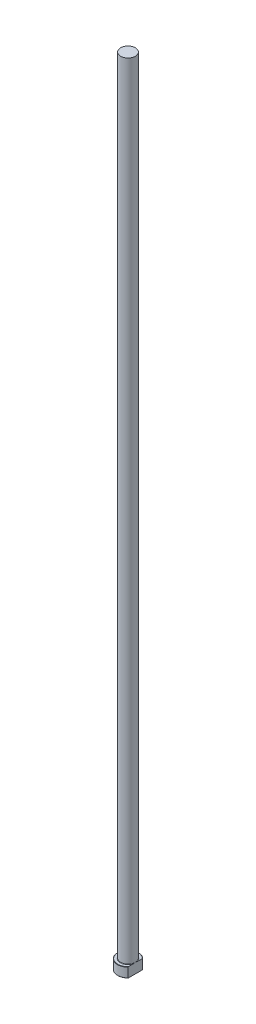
ISO-10303-21;
HEADER;
FILE_DESCRIPTION(('STEP AP214'),'2;1');
FILE_NAME('part.step','',(''),(''),'','','');
FILE_SCHEMA(('AUTOMOTIVE_DESIGN { 1 0 10303 214 1 1 1 1 }'));
ENDSEC;
DATA;
#1=APPLICATION_CONTEXT('core data for automotive mechanical design processes');
#2=APPLICATION_PROTOCOL_DEFINITION('international standard','automotive_design',2000,#1);
#3=PRODUCT_CONTEXT('',#1,'mechanical');
#4=PRODUCT('Part','Part','',(#3));
#5=PRODUCT_RELATED_PRODUCT_CATEGORY('part','',(#4));
#6=PRODUCT_DEFINITION_FORMATION('','',#4);
#7=PRODUCT_DEFINITION_CONTEXT('part definition',#1,'design');
#8=PRODUCT_DEFINITION('design','',#6,#7);
#9=PRODUCT_DEFINITION_SHAPE('','',#8);
#10=(LENGTH_UNIT() NAMED_UNIT(*) SI_UNIT(.MILLI.,.METRE.));
#11=(NAMED_UNIT(*) PLANE_ANGLE_UNIT() SI_UNIT($,.RADIAN.));
#12=(NAMED_UNIT(*) SI_UNIT($,.STERADIAN.) SOLID_ANGLE_UNIT());
#13=UNCERTAINTY_MEASURE_WITH_UNIT(LENGTH_MEASURE(1.E-05),#10,'distance_accuracy_value','');
#14=(GEOMETRIC_REPRESENTATION_CONTEXT(3) GLOBAL_UNCERTAINTY_ASSIGNED_CONTEXT((#13)) GLOBAL_UNIT_ASSIGNED_CONTEXT((#10,
#11,#12)) REPRESENTATION_CONTEXT('',''));
#15=CARTESIAN_POINT('',(0.,0.,0.));
#16=DIRECTION('',(0.,0.,1.));
#17=DIRECTION('',(1.,0.,0.));
#18=AXIS2_PLACEMENT_3D('',#15,#16,#17);
#19=CARTESIAN_POINT('',(0.,0.,0.));
#20=DIRECTION('',(0.,-1.,0.));
#21=DIRECTION('',(0.,0.,-1.));
#22=AXIS2_PLACEMENT_3D('',#19,#20,#21);
#23=PLANE('',#22);
#24=CARTESIAN_POINT('',(0.,0.,0.));
#25=DIRECTION('',(0.,-1.,0.));
#26=DIRECTION('',(0.,0.,-1.));
#27=AXIS2_PLACEMENT_3D('',#24,#25,#26);
#28=CIRCLE('',#27,8.29999999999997);
#29=CARTESIAN_POINT('',(5.99999999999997,0.,5.73498038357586));
#30=VERTEX_POINT('',#29);
#31=CARTESIAN_POINT('',(5.99999999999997,0.,-5.73498038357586));
#32=VERTEX_POINT('',#31);
#33=EDGE_CURVE('E98',#30,#32,#28,.T.);
#34=ORIENTED_EDGE('',*,*,#33,.T.);
#35=DIRECTION('',(0.,0.,1.));
#36=VECTOR('',#35,1.);
#37=CARTESIAN_POINT('',(5.99999999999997,0.,6.02079728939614));
#38=LINE('',#37,#36);
#39=EDGE_CURVE('E83',#32,#30,#38,.T.);
#40=ORIENTED_EDGE('',*,*,#39,.T.);
#41=EDGE_LOOP('',(#34,#40));
#42=FACE_BOUND('',#41,.T.);
#43=ADVANCED_FACE('F32',(#42),#23,.T.);
#44=CARTESIAN_POINT('',(0.,259.958771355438,0.));
#45=DIRECTION('',(0.,1.,0.));
#46=DIRECTION('',(0.,0.,1.));
#47=AXIS2_PLACEMENT_3D('',#44,#45,#46);
#48=CYLINDRICAL_SURFACE('',#47,8.49999999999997);
#49=CARTESIAN_POINT('',(0.,7.80000000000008,0.));
#50=DIRECTION('',(0.,1.,0.));
#51=DIRECTION('',(0.,0.,1.));
#52=AXIS2_PLACEMENT_3D('',#49,#50,#51);
#53=CIRCLE('',#52,8.49999999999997);
#54=CARTESIAN_POINT('',(5.99999999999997,7.80000000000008,6.02079728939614));
#55=VERTEX_POINT('',#54);
#56=CARTESIAN_POINT('',(5.99999999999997,7.80000000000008,-6.02079728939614));
#57=VERTEX_POINT('',#56);
#58=EDGE_CURVE('E104',#55,#57,#53,.F.);
#59=ORIENTED_EDGE('',*,*,#58,.T.);
#60=DIRECTION('',(0.,-1.,0.));
#61=VECTOR('',#60,1.);
#62=CARTESIAN_POINT('',(5.99999999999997,650.,-6.02079728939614));
#63=LINE('',#62,#61);
#64=CARTESIAN_POINT('',(5.99999999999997,0.200000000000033,-6.02079728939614));
#65=VERTEX_POINT('',#64);
#66=EDGE_CURVE('E183',#57,#65,#63,.T.);
#67=ORIENTED_EDGE('',*,*,#66,.T.);
#68=CARTESIAN_POINT('',(0.,0.200000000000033,0.));
#69=DIRECTION('',(0.,-1.,0.));
#70=DIRECTION('',(0.,0.,-1.));
#71=AXIS2_PLACEMENT_3D('',#68,#69,#70);
#72=CIRCLE('',#71,8.49999999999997);
#73=CARTESIAN_POINT('',(5.99999999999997,0.200000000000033,6.02079728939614));
#74=VERTEX_POINT('',#73);
#75=EDGE_CURVE('E100',#65,#74,#72,.F.);
#76=ORIENTED_EDGE('',*,*,#75,.T.);
#77=DIRECTION('',(0.,-1.,0.));
#78=VECTOR('',#77,1.);
#79=CARTESIAN_POINT('',(5.99999999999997,650.,6.02079728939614));
#80=LINE('',#79,#78);
#81=EDGE_CURVE('E93',#55,#74,#80,.T.);
#82=ORIENTED_EDGE('',*,*,#81,.F.);
#83=EDGE_LOOP('',(#59,#67,#76,#82));
#84=FACE_BOUND('',#83,.T.);
#85=ADVANCED_FACE('F158',(#84),#48,.T.);
#86=CARTESIAN_POINT('',(-8.49999999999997,8.,0.));
#87=DIRECTION('',(0.,1.,0.));
#88=DIRECTION('',(0.,0.,1.));
#89=AXIS2_PLACEMENT_3D('',#86,#87,#88);
#90=PLANE('',#89);
#91=CARTESIAN_POINT('',(0.,8.,0.));
#92=DIRECTION('',(0.,1.,0.));
#93=DIRECTION('',(0.,0.,1.));
#94=AXIS2_PLACEMENT_3D('',#91,#92,#93);
#95=CIRCLE('',#94,8.30000000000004);
#96=CARTESIAN_POINT('',(5.99999999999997,8.,-5.73498038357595));
#97=VERTEX_POINT('',#96);
#98=CARTESIAN_POINT('',(5.99999999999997,8.,5.73498038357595));
#99=VERTEX_POINT('',#98);
#100=EDGE_CURVE('E178',#97,#99,#95,.T.);
#101=ORIENTED_EDGE('',*,*,#100,.T.);
#102=DIRECTION('',(0.,0.,-1.));
#103=VECTOR('',#102,1.);
#104=CARTESIAN_POINT('',(5.99999999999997,8.,0.));
#105=LINE('',#104,#103);
#106=CARTESIAN_POINT('',(5.99999999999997,7.99999999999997,1.92093727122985));
#107=VERTEX_POINT('',#106);
#108=EDGE_CURVE('E57',#99,#107,#105,.T.);
#109=ORIENTED_EDGE('',*,*,#108,.T.);
#110=CARTESIAN_POINT('',(0.,8.,0.));
#111=DIRECTION('',(0.,1.,0.));
#112=DIRECTION('',(0.,0.,1.));
#113=AXIS2_PLACEMENT_3D('',#110,#111,#112);
#114=CIRCLE('',#113,6.29999999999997);
#115=CARTESIAN_POINT('',(5.99999999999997,7.99999999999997,-1.92093727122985));
#116=VERTEX_POINT('',#115);
#117=EDGE_CURVE('E107',#107,#116,#114,.F.);
#118=ORIENTED_EDGE('',*,*,#117,.T.);
#119=EDGE_CURVE('E136',#116,#97,#105,.T.);
#120=ORIENTED_EDGE('',*,*,#119,.T.);
#121=EDGE_LOOP('',(#101,#109,#118,#120));
#122=FACE_BOUND('',#121,.T.);
#123=ADVANCED_FACE('F147',(#122),#90,.T.);
#124=CARTESIAN_POINT('',(0.,8.00000000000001,0.));
#125=DIRECTION('',(0.,-1.,0.));
#126=DIRECTION('',(0.,0.,-1.));
#127=AXIS2_PLACEMENT_3D('',#124,#125,#126);
#128=CONICAL_SURFACE('',#127,8.30000000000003,0.785398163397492);
#129=ORIENTED_EDGE('',*,*,#58,.F.);
#130=CARTESIAN_POINT('',(5.99999999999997,1.75758968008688,13.2469505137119));
#131=CARTESIAN_POINT('',(5.99999999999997,1.93438223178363,13.0528651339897));
#132=CARTESIAN_POINT('',(5.99999999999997,2.11081737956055,12.8584542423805));
#133=CARTESIAN_POINT('',(5.99999999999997,2.4628681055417,12.4688887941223));
#134=CARTESIAN_POINT('',(5.99999999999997,2.63848367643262,12.2737342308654));
#135=CARTESIAN_POINT('',(5.99999999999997,3.16402789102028,11.6869221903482));
#136=CARTESIAN_POINT('',(5.99999999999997,3.51256436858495,11.2940145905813));
#137=CARTESIAN_POINT('',(5.99999999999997,4.20737297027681,10.5008820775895));
#138=CARTESIAN_POINT('',(5.99999999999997,4.55360756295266,10.1006242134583));
#139=CARTESIAN_POINT('',(5.99999999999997,5.23924501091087,9.29437446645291));
#140=CARTESIAN_POINT('',(5.99999999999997,5.57864880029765,8.88838338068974));
#141=CARTESIAN_POINT('',(5.99999999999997,6.20014365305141,8.12701556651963));
#142=CARTESIAN_POINT('',(5.99999999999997,6.48350363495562,7.77268056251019));
#143=CARTESIAN_POINT('',(5.99999999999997,6.9011847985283,7.23535305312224));
#144=CARTESIAN_POINT('',(5.99999999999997,7.03920968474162,7.05523994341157));
#145=CARTESIAN_POINT('',(5.99999999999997,7.31228512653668,6.6927759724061));
#146=CARTESIAN_POINT('',(5.99999999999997,7.44733576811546,6.51042517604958));
#147=CARTESIAN_POINT('',(5.99999999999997,7.7136549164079,6.14339029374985));
#148=CARTESIAN_POINT('',(5.99999999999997,7.84492875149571,5.9587100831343));
#149=CARTESIAN_POINT('',(5.99999999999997,8.10310710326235,5.586328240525));
#150=CARTESIAN_POINT('',(5.99999999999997,8.23001189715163,5.3986268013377));
#151=CARTESIAN_POINT('',(5.99999999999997,8.47838103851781,5.01977879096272));
#152=CARTESIAN_POINT('',(5.99999999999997,8.59984807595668,4.82863399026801));
#153=CARTESIAN_POINT('',(5.99999999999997,8.83606873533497,4.44225695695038));
#154=CARTESIAN_POINT('',(5.99999999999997,8.95082335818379,4.24702533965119));
#155=CARTESIAN_POINT('',(5.99999999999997,9.16834438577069,3.8581909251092));
#156=CARTESIAN_POINT('',(5.99999999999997,9.27137801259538,3.66473854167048));
#157=CARTESIAN_POINT('',(5.99999999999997,9.46754050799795,3.27281000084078));
#158=CARTESIAN_POINT('',(5.99999999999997,9.56066848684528,3.07433339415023));
#159=CARTESIAN_POINT('',(5.99999999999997,9.73431152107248,2.67227927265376));
#160=CARTESIAN_POINT('',(5.99999999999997,9.81484758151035,2.46871092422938));
#161=CARTESIAN_POINT('',(5.99999999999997,9.96042306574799,2.05607448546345));
#162=CARTESIAN_POINT('',(5.99999999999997,10.0254667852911,1.84700793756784));
#163=CARTESIAN_POINT('',(5.99999999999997,10.1264114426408,1.46315432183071));
#164=CARTESIAN_POINT('',(5.99999999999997,10.1654805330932,1.28920535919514));
#165=CARTESIAN_POINT('',(5.99999999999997,10.2294553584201,0.938706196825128));
#166=CARTESIAN_POINT('',(5.99999999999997,10.2543631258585,0.762156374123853));
#167=CARTESIAN_POINT('',(5.99999999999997,10.2887297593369,0.40789035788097));
#168=CARTESIAN_POINT('',(5.99999999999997,10.2982190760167,0.230177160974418));
#169=CARTESIAN_POINT('',(5.99999999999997,10.301323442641,-0.125392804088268));
#170=CARTESIAN_POINT('',(5.99999999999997,10.2949382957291,-0.303249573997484));
#171=CARTESIAN_POINT('',(5.99999999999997,10.2666831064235,-0.657249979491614));
#172=CARTESIAN_POINT('',(5.99999999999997,10.2448527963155,-0.83339683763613));
#173=CARTESIAN_POINT('',(5.99999999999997,10.1868620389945,-1.18332422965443));
#174=CARTESIAN_POINT('',(5.99999999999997,10.1506981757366,-1.35710418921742));
#175=CARTESIAN_POINT('',(5.99999999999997,10.0655340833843,-1.70193222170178));
#176=CARTESIAN_POINT('',(5.99999999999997,10.0165006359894,-1.87297199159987));
#177=CARTESIAN_POINT('',(5.99999999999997,9.90743707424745,-2.21145638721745));
#178=CARTESIAN_POINT('',(5.99999999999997,9.84740753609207,-2.37890120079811));
#179=CARTESIAN_POINT('',(5.99999999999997,9.69449933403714,-2.77055604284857));
#180=CARTESIAN_POINT('',(5.99999999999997,9.597624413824,-2.99320000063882));
#181=CARTESIAN_POINT('',(5.99999999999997,9.39041412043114,-3.43217897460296));
#182=CARTESIAN_POINT('',(5.99999999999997,9.28007160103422,-3.64851056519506));
#183=CARTESIAN_POINT('',(5.99999999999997,9.04872697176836,-4.07594347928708));
#184=CARTESIAN_POINT('',(5.99999999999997,8.92770286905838,-4.28703280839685));
#185=CARTESIAN_POINT('',(5.99999999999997,8.67752421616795,-4.70425268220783));
#186=CARTESIAN_POINT('',(5.99999999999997,8.54837109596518,-4.91038409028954));
#187=CARTESIAN_POINT('',(5.99999999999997,8.28223284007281,-5.32064004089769));
#188=CARTESIAN_POINT('',(5.99999999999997,8.1451788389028,-5.52471970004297));
#189=CARTESIAN_POINT('',(5.99999999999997,7.86585169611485,-5.92927121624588));
#190=CARTESIAN_POINT('',(5.99999999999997,7.72357838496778,-6.12974295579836));
#191=CARTESIAN_POINT('',(5.99999999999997,7.43500571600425,-6.52738897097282));
#192=CARTESIAN_POINT('',(5.99999999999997,7.28871143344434,-6.72456694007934));
#193=CARTESIAN_POINT('',(5.99999999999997,6.99270011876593,-7.11633919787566));
#194=CARTESIAN_POINT('',(5.99999999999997,6.84298299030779,-7.31093341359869));
#195=CARTESIAN_POINT('',(5.99999999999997,6.4945641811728,-7.75702816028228));
#196=CARTESIAN_POINT('',(5.99999999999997,6.29487025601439,-8.00775292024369));
#197=CARTESIAN_POINT('',(5.99999999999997,5.89169138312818,-8.50613413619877));
#198=CARTESIAN_POINT('',(5.99999999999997,5.68820636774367,-8.75379053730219));
#199=CARTESIAN_POINT('',(5.99999999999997,5.27809760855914,-9.24667622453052));
#200=CARTESIAN_POINT('',(5.99999999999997,5.07147248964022,-9.4919043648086));
#201=CARTESIAN_POINT('',(5.99999999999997,4.65573644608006,-9.98024423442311));
#202=CARTESIAN_POINT('',(5.99999999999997,4.44662550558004,-10.2233559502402));
#203=CARTESIAN_POINT('',(5.99999999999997,4.03294810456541,-10.7001949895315));
#204=CARTESIAN_POINT('',(5.99999999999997,3.82844502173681,-10.9339773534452));
#205=CARTESIAN_POINT('',(5.99999999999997,3.41782118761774,-11.4001180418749));
#206=CARTESIAN_POINT('',(5.99999999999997,3.21170042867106,-11.6324763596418));
#207=CARTESIAN_POINT('',(5.99999999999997,2.79824862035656,-12.0957939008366));
#208=CARTESIAN_POINT('',(5.99999999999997,2.5909186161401,-12.3267540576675));
#209=CARTESIAN_POINT('',(5.99999999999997,2.17508648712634,-12.7876097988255));
#210=CARTESIAN_POINT('',(5.99999999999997,1.9665843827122,-13.0175054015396));
#211=CARTESIAN_POINT('',(5.99999999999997,1.75758968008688,-13.2469505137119));
#212=B_SPLINE_CURVE_WITH_KNOTS('',3,(#130,#131,#132,#133,#134,#135,#136,#137,#138,#139,#140,
#141,#142,#143,#144,#145,#146,#147,#148,#149,#150,#151,#152,#153,#154,#155,#156,#157,#158,#159,
#160,#161,#162,#163,#164,#165,#166,#167,#168,#169,#170,#171,#172,#173,#174,#175,#176,#177,#178,
#179,#180,#181,#182,#183,#184,#185,#186,#187,#188,#189,#190,#191,#192,#193,#194,#195,#196,#197,
#198,#199,#200,#201,#202,#203,#204,#205,#206,#207,#208,#209,#210,#211),.UNSPECIFIED.,.F.,.F.,(4,
2,2,2,2,2,2,2,2,2,2,2,2,2,2,2,2,2,2,2,2,2,2,2,2,2,2,2,2,2,2,2,2,2,2,2,2,2,2,2,4),(0.,
0.787604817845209,1.57521665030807,3.15083930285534,4.73847641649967,6.32589492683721,
7.68685989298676,8.36758868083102,9.04829776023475,9.72799402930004,10.4076470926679,
11.0869601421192,11.7661716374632,12.4234853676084,13.0808580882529,13.7371222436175,
14.3932042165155,14.9275387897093,15.4617966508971,15.9949980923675,16.5282061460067,
17.0600474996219,17.5920156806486,18.1253706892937,18.6586977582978,19.3865060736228,
20.1147022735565,20.8444344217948,21.5740385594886,22.3114278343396,23.0488410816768,
23.7853628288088,24.5219053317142,25.4834511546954,26.4450141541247,27.4070111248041,
28.3690142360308,29.3008217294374,30.2326336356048,31.1637335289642,32.0948172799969),.UNSPECIFIED.);
#213=EDGE_CURVE('E135',#55,#99,#212,.T.);
#214=ORIENTED_EDGE('',*,*,#213,.T.);
#215=ORIENTED_EDGE('',*,*,#100,.F.);
#216=EDGE_CURVE('E127',#97,#57,#212,.T.);
#217=ORIENTED_EDGE('',*,*,#216,.T.);
#218=EDGE_LOOP('',(#129,#214,#215,#217));
#219=FACE_BOUND('',#218,.T.);
#220=ADVANCED_FACE('F143',(#219),#128,.T.);
#221=CARTESIAN_POINT('',(0.,0.200000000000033,0.));
#222=DIRECTION('',(0.,1.,0.));
#223=DIRECTION('',(0.,0.,1.));
#224=AXIS2_PLACEMENT_3D('',#221,#222,#223);
#225=CONICAL_SURFACE('',#224,8.49999999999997,0.785398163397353);
#226=ORIENTED_EDGE('',*,*,#75,.F.);
#227=CARTESIAN_POINT('',(5.99999999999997,6.24241031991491,-13.2469505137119));
#228=CARTESIAN_POINT('',(5.99999999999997,6.06561776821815,-13.0528651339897));
#229=CARTESIAN_POINT('',(5.99999999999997,5.88918262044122,-12.8584542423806));
#230=CARTESIAN_POINT('',(5.99999999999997,5.53713189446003,-12.4688887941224));
#231=CARTESIAN_POINT('',(5.99999999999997,5.36151632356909,-12.2737342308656));
#232=CARTESIAN_POINT('',(5.99999999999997,4.83597210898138,-11.6869221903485));
#233=CARTESIAN_POINT('',(5.99999999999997,4.48743563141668,-11.2940145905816));
#234=CARTESIAN_POINT('',(5.99999999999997,3.79262702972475,-10.50088207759));
#235=CARTESIAN_POINT('',(5.99999999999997,3.44639243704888,-10.1006242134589));
#236=CARTESIAN_POINT('',(5.99999999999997,2.7607549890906,-9.29437446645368));
#237=CARTESIAN_POINT('',(5.99999999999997,2.42135119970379,-8.88838338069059));
#238=CARTESIAN_POINT('',(5.99999999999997,1.79985634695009,-8.12701556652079));
#239=CARTESIAN_POINT('',(5.99999999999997,1.51649636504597,-7.77268056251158));
#240=CARTESIAN_POINT('',(5.99999999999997,1.09881520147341,-7.23535305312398));
#241=CARTESIAN_POINT('',(5.99999999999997,0.960790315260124,-7.05523994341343));
#242=CARTESIAN_POINT('',(5.99999999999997,0.687714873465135,-6.69277597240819));
#243=CARTESIAN_POINT('',(5.99999999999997,0.552664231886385,-6.5104251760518));
#244=CARTESIAN_POINT('',(5.99999999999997,0.286345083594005,-6.14339029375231));
#245=CARTESIAN_POINT('',(5.99999999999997,0.15507124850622,-5.95871008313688));
#246=CARTESIAN_POINT('',(5.99999999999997,-0.103107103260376,-5.58632824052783));
#247=CARTESIAN_POINT('',(5.99999999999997,-0.230011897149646,-5.39862680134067));
#248=CARTESIAN_POINT('',(5.99999999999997,-0.478381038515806,-5.01977879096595));
#249=CARTESIAN_POINT('',(5.99999999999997,-0.599848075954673,-4.82863399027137));
#250=CARTESIAN_POINT('',(5.99999999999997,-0.83606873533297,-4.44225695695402));
#251=CARTESIAN_POINT('',(5.99999999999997,-0.950823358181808,-4.24702533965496));
#252=CARTESIAN_POINT('',(5.99999999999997,-1.16834438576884,-3.8581909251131));
#253=CARTESIAN_POINT('',(5.99999999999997,-1.27137801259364,-3.66473854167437));
#254=CARTESIAN_POINT('',(5.99999999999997,-1.46754050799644,-3.27281000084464));
#255=CARTESIAN_POINT('',(5.99999999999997,-1.5606684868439,-3.07433339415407));
#256=CARTESIAN_POINT('',(5.99999999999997,-1.73431152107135,-2.67227927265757));
#257=CARTESIAN_POINT('',(5.99999999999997,-1.81484758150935,-2.46871092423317));
#258=CARTESIAN_POINT('',(5.99999999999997,-1.96042306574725,-2.05607448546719));
#259=CARTESIAN_POINT('',(5.99999999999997,-2.02546678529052,-1.84700793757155));
#260=CARTESIAN_POINT('',(5.99999999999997,-2.12641144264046,-1.46315432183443));
#261=CARTESIAN_POINT('',(5.99999999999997,-2.16548053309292,-1.28920535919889));
#262=CARTESIAN_POINT('',(5.99999999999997,-2.22945535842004,-0.938706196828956));
#263=CARTESIAN_POINT('',(5.99999999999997,-2.25436312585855,-0.762156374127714));
#264=CARTESIAN_POINT('',(5.99999999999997,-2.28872975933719,-0.407890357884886));
#265=CARTESIAN_POINT('',(5.99999999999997,-2.29821907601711,-0.230177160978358));
#266=CARTESIAN_POINT('',(5.99999999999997,-2.30132344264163,0.12539280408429));
#267=CARTESIAN_POINT('',(5.99999999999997,-2.29493829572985,0.303249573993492));
#268=CARTESIAN_POINT('',(5.99999999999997,-2.26668310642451,0.657249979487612));
#269=CARTESIAN_POINT('',(5.99999999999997,-2.2448527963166,0.833396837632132));
#270=CARTESIAN_POINT('',(5.99999999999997,-2.1868620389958,1.18332422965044));
#271=CARTESIAN_POINT('',(5.99999999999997,-2.150698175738,1.35710418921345));
#272=CARTESIAN_POINT('',(5.99999999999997,-2.06553408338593,1.70193222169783));
#273=CARTESIAN_POINT('',(5.99999999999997,-2.01650063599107,1.87297199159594));
#274=CARTESIAN_POINT('',(5.99999999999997,-1.90743707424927,2.21145638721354));
#275=CARTESIAN_POINT('',(5.99999999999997,-1.84740753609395,2.37890120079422));
#276=CARTESIAN_POINT('',(5.99999999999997,-1.69449933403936,2.77055604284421));
#277=CARTESIAN_POINT('',(5.99999999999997,-1.59762441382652,2.99320000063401));
#278=CARTESIAN_POINT('',(5.99999999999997,-1.39041412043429,3.43217897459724));
#279=CARTESIAN_POINT('',(5.99999999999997,-1.28007160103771,3.6485105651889));
#280=CARTESIAN_POINT('',(5.99999999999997,-1.04872697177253,4.07594347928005));
#281=CARTESIAN_POINT('',(5.99999999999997,-0.927702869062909,4.2870328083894));
#282=CARTESIAN_POINT('',(5.99999999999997,-0.677524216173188,4.70425268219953));
#283=CARTESIAN_POINT('',(5.99999999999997,-0.548371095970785,4.91038409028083));
#284=CARTESIAN_POINT('',(5.99999999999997,-0.282232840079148,5.32064004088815));
#285=CARTESIAN_POINT('',(5.99999999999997,-0.145178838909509,5.52471970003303));
#286=CARTESIAN_POINT('',(5.99999999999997,0.134148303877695,5.92927121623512));
#287=CARTESIAN_POINT('',(5.99999999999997,0.276421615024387,6.12974295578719));
#288=CARTESIAN_POINT('',(5.99999999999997,0.564994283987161,6.52738897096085));
#289=CARTESIAN_POINT('',(5.99999999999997,0.711288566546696,6.72456694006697));
#290=CARTESIAN_POINT('',(5.99999999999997,1.00729988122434,7.11633919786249));
#291=CARTESIAN_POINT('',(5.99999999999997,1.15701700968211,7.31093341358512));
#292=CARTESIAN_POINT('',(5.99999999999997,1.50543581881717,7.757028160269));
#293=CARTESIAN_POINT('',(5.99999999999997,1.70512974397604,8.00775292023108));
#294=CARTESIAN_POINT('',(5.99999999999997,2.10830861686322,8.50613413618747));
#295=CARTESIAN_POINT('',(5.99999999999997,2.31179363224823,8.75379053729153));
#296=CARTESIAN_POINT('',(5.99999999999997,2.72190239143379,9.24667622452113));
#297=CARTESIAN_POINT('',(5.99999999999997,2.92852751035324,9.49190436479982));
#298=CARTESIAN_POINT('',(5.99999999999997,3.34426355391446,9.98024423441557));
#299=CARTESIAN_POINT('',(5.99999999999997,3.55337449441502,10.2233559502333));
#300=CARTESIAN_POINT('',(5.99999999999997,3.96705189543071,10.7001949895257));
#301=CARTESIAN_POINT('',(5.99999999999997,4.17155497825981,10.9339773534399));
#302=CARTESIAN_POINT('',(5.99999999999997,4.58217881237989,11.4001180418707));
#303=CARTESIAN_POINT('',(5.99999999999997,4.78829957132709,11.6324763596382));
#304=CARTESIAN_POINT('',(5.99999999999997,5.20175137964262,12.095793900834));
#305=CARTESIAN_POINT('',(5.99999999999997,5.40908138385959,12.3267540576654));
#306=CARTESIAN_POINT('',(5.99999999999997,5.82491351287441,12.7876097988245));
#307=CARTESIAN_POINT('',(5.99999999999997,6.03341561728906,13.0175054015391));
#308=CARTESIAN_POINT('',(5.99999999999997,6.24241031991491,13.2469505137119));
#309=B_SPLINE_CURVE_WITH_KNOTS('',3,(#227,#228,#229,#230,#231,#232,#233,#234,#235,#236,#237,
#238,#239,#240,#241,#242,#243,#244,#245,#246,#247,#248,#249,#250,#251,#252,#253,#254,#255,#256,
#257,#258,#259,#260,#261,#262,#263,#264,#265,#266,#267,#268,#269,#270,#271,#272,#273,#274,#275,
#276,#277,#278,#279,#280,#281,#282,#283,#284,#285,#286,#287,#288,#289,#290,#291,#292,#293,#294,
#295,#296,#297,#298,#299,#300,#301,#302,#303,#304,#305,#306,#307,#308),.UNSPECIFIED.,.F.,.F.,(4,
2,2,2,2,2,2,2,2,2,2,2,2,2,2,2,2,2,2,2,2,2,2,2,2,2,2,2,2,2,2,2,2,2,2,2,2,2,2,2,4),(0.,
0.787604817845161,1.57521665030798,3.15083930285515,4.73847641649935,6.32589492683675,
7.6868598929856,8.36758868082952,9.0482977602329,9.72799402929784,10.4076470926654,
11.0869601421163,11.76617163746,12.4234853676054,13.08085808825,13.7371222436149,
14.3932042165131,14.9275387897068,15.4617966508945,15.9949980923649,16.528206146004,
17.0600474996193,17.5920156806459,18.125370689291,18.658697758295,19.3865060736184,
20.1147022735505,20.8444344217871,21.5740385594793,22.3114278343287,23.0488410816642,
23.7853628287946,24.5219053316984,25.4834511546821,26.4450141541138,27.4070111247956,
28.3690142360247,29.3008217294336,30.2326336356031,31.1637335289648,32.0948172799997),.UNSPECIFIED.);
#310=EDGE_CURVE('E86',#65,#32,#309,.T.);
#311=ORIENTED_EDGE('',*,*,#310,.T.);
#312=ORIENTED_EDGE('',*,*,#33,.F.);
#313=EDGE_CURVE('E89',#30,#74,#309,.T.);
#314=ORIENTED_EDGE('',*,*,#313,.T.);
#315=EDGE_LOOP('',(#226,#311,#312,#314));
#316=FACE_BOUND('',#315,.T.);
#317=ADVANCED_FACE('F97',(#316),#225,.T.);
#318=CARTESIAN_POINT('',(0.,8.29999999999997,0.));
#319=DIRECTION('',(0.,1.,0.));
#320=DIRECTION('',(0.,0.,1.));
#321=AXIS2_PLACEMENT_3D('',#318,#319,#320);
#322=TOROIDAL_SURFACE('',#321,6.29999999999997,0.3);
#323=CARTESIAN_POINT('',(5.99999999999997,8.29999999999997,0.));
#324=CARTESIAN_POINT('',(5.99999999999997,8.30000062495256,1.34604190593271E-10));
#325=CARTESIAN_POINT('',(5.99999999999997,8.30000124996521,-2.85495124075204E-07));
#326=CARTESIAN_POINT('',(5.99999999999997,8.30000241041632,-1.04928093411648E-06));
#327=CARTESIAN_POINT('',(5.99999999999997,8.3000029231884,-1.54785174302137E-06));
#328=CARTESIAN_POINT('',(5.99999999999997,8.30000401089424,-2.74944388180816E-06));
#329=CARTESIAN_POINT('',(5.99999999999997,8.30000456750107,-3.47196545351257E-06));
#330=CARTESIAN_POINT('',(5.99999999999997,8.30000554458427,-4.95172589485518E-06));
#331=CARTESIAN_POINT('',(5.99999999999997,8.30000596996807,-5.70604371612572E-06));
#332=CARTESIAN_POINT('',(5.99999999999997,8.30000759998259,-8.69525120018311E-06));
#333=CARTESIAN_POINT('',(5.99999999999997,8.30000872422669,-1.09781829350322E-05));
#334=CARTESIAN_POINT('',(5.99999999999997,8.30001052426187,-1.54456348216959E-05));
#335=CARTESIAN_POINT('',(5.99999999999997,8.30001123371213,-1.7617076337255E-05));
#336=CARTESIAN_POINT('',(5.99999999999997,8.30001429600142,-2.6992812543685E-05));
#337=CARTESIAN_POINT('',(5.99999999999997,8.30001664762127,-3.4200026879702E-05));
#338=CARTESIAN_POINT('',(5.99999999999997,8.30002002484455,-4.76829004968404E-05));
#339=CARTESIAN_POINT('',(5.99999999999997,8.30002120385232,-5.39195612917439E-05));
#340=CARTESIAN_POINT('',(5.99999999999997,8.3000299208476,-0.000100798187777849));
#341=CARTESIAN_POINT('',(5.99999999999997,8.30003667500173,-0.00014152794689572));
#342=CARTESIAN_POINT('',(5.99999999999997,8.30006623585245,-0.000303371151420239));
#343=CARTESIAN_POINT('',(5.99999999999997,8.30009428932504,-0.000423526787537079));
#344=CARTESIAN_POINT('',(5.99999999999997,8.30020425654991,-0.000901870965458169));
#345=CARTESIAN_POINT('',(5.99999999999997,8.30028289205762,-0.00126055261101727));
#346=CARTESIAN_POINT('',(5.99999999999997,8.3005993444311,-0.00269405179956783));
#347=CARTESIAN_POINT('',(5.99999999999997,8.30084137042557,-0.00376821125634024));
#348=CARTESIAN_POINT('',(5.99999999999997,8.30185255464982,-0.0082672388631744));
#349=CARTESIAN_POINT('',(5.99999999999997,8.30261638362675,-0.0116929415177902));
#350=CARTESIAN_POINT('',(5.99999999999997,8.30945824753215,-0.0423635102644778));
#351=CARTESIAN_POINT('',(5.99999999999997,8.31555811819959,-0.0696050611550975));
#352=CARTESIAN_POINT('',(5.99999999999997,8.3274771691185,-0.122985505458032));
#353=CARTESIAN_POINT('',(5.99999999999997,8.33329766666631,-0.149124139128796));
#354=CARTESIAN_POINT('',(5.99999999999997,8.34565922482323,-0.204790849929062));
#355=CARTESIAN_POINT('',(5.99999999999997,8.35219607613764,-0.234319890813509));
#356=CARTESIAN_POINT('',(5.99999999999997,8.36527652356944,-0.293721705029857));
#357=CARTESIAN_POINT('',(5.99999999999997,8.37181938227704,-0.323594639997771));
#358=CARTESIAN_POINT('',(5.99999999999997,8.38741819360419,-0.395325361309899));
#359=CARTESIAN_POINT('',(5.99999999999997,8.39643140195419,-0.437192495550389));
#360=CARTESIAN_POINT('',(5.99999999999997,8.41397520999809,-0.519837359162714));
#361=CARTESIAN_POINT('',(5.99999999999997,8.42251226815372,-0.560613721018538));
#362=CARTESIAN_POINT('',(5.99999999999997,8.45005469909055,-0.694529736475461));
#363=CARTESIAN_POINT('',(5.99999999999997,8.4684527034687,-0.787796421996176));
#364=CARTESIAN_POINT('',(5.99999999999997,8.50309772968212,-0.975673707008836));
#365=CARTESIAN_POINT('',(5.99999999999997,8.51932210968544,-1.07028855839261));
#366=CARTESIAN_POINT('',(5.99999999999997,8.54979671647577,-1.26922112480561));
#367=CARTESIAN_POINT('',(5.99999999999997,8.56370439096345,-1.37359247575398));
#368=CARTESIAN_POINT('',(5.99999999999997,8.58567213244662,-1.58267692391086));
#369=CARTESIAN_POINT('',(5.99999999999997,8.59375049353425,-1.6873879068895));
#370=CARTESIAN_POINT('',(5.99999999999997,8.59943466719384,-1.84308999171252));
#371=CARTESIAN_POINT('',(5.99999999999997,8.60029184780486,-1.89396002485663));
#372=CARTESIAN_POINT('',(5.99999999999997,8.5995288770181,-1.99574511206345));
#373=CARTESIAN_POINT('',(5.99999999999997,8.59790613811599,-2.04666015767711));
#374=CARTESIAN_POINT('',(5.99999999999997,8.59158346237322,-2.14740525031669));
#375=CARTESIAN_POINT('',(5.99999999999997,8.58693864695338,-2.1972385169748));
#376=CARTESIAN_POINT('',(5.99999999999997,8.57369485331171,-2.29634018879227));
#377=CARTESIAN_POINT('',(5.99999999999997,8.56510170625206,-2.34560931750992));
#378=CARTESIAN_POINT('',(5.99999999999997,8.54513600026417,-2.43101613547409));
#379=CARTESIAN_POINT('',(5.99999999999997,8.53495732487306,-2.46741817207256));
#380=CARTESIAN_POINT('',(5.99999999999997,8.5163599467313,-2.52083307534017));
#381=CARTESIAN_POINT('',(5.99999999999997,8.50961541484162,-2.53842082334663));
#382=CARTESIAN_POINT('',(5.99999999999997,8.49476050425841,-2.57300282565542));
#383=CARTESIAN_POINT('',(5.99999999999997,8.48665036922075,-2.58999718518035));
#384=CARTESIAN_POINT('',(5.99999999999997,8.4656679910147,-2.62872971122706));
#385=CARTESIAN_POINT('',(5.99999999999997,8.45211281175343,-2.65012863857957));
#386=CARTESIAN_POINT('',(5.99999999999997,8.42848584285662,-2.67978235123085));
#387=CARTESIAN_POINT('',(5.99999999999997,8.42001211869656,-2.68929941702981));
#388=CARTESIAN_POINT('',(5.99999999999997,8.40175979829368,-2.70700164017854));
#389=CARTESIAN_POINT('',(5.99999999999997,8.3919842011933,-2.71518976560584));
#390=CARTESIAN_POINT('',(5.99999999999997,8.37475773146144,-2.72695700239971));
#391=CARTESIAN_POINT('',(5.99999999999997,8.36772137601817,-2.73113834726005));
#392=CARTESIAN_POINT('',(5.99999999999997,8.35309194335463,-2.73838811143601));
#393=CARTESIAN_POINT('',(5.99999999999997,8.34549938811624,-2.7414575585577));
#394=CARTESIAN_POINT('',(5.99999999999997,8.32979919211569,-2.74623687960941));
#395=CARTESIAN_POINT('',(5.99999999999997,8.32168697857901,-2.74793213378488));
#396=CARTESIAN_POINT('',(5.99999999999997,8.30528814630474,-2.74970225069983));
#397=CARTESIAN_POINT('',(5.99999999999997,8.29700168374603,-2.74977850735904));
#398=CARTESIAN_POINT('',(5.99999999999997,8.2816016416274,-2.74839814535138));
#399=CARTESIAN_POINT('',(5.99999999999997,8.27447007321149,-2.74713049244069));
#400=CARTESIAN_POINT('',(5.99999999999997,8.26050316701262,-2.74347158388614));
#401=CARTESIAN_POINT('',(5.99999999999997,8.25366802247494,-2.7410796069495));
#402=CARTESIAN_POINT('',(5.99999999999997,8.23783277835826,-2.73423902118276));
#403=CARTESIAN_POINT('',(5.99999999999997,8.22902314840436,-2.72935244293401));
#404=CARTESIAN_POINT('',(5.99999999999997,8.21228574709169,-2.7182516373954));
#405=CARTESIAN_POINT('',(5.99999999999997,8.20436026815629,-2.71203407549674));
#406=CARTESIAN_POINT('',(5.99999999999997,8.18433696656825,-2.69420240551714));
#407=CARTESIAN_POINT('',(5.99999999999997,8.17298706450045,-2.68175715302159));
#408=CARTESIAN_POINT('',(5.99999999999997,8.15219498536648,-2.65539556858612));
#409=CARTESIAN_POINT('',(5.99999999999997,8.14275658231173,-2.64147640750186));
#410=CARTESIAN_POINT('',(5.99999999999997,8.12508934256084,-2.61223187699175));
#411=CARTESIAN_POINT('',(5.99999999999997,8.11691464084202,-2.59687428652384));
#412=CARTESIAN_POINT('',(5.99999999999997,8.10186133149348,-2.56552911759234));
#413=CARTESIAN_POINT('',(5.99999999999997,8.09498416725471,-2.54954086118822));
#414=CARTESIAN_POINT('',(5.99999999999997,8.07586257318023,-2.50075322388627));
#415=CARTESIAN_POINT('',(5.99999999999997,8.06523495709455,-2.46732486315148));
#416=CARTESIAN_POINT('',(5.99999999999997,8.04175411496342,-2.38014114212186));
#417=CARTESIAN_POINT('',(5.99999999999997,8.0311656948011,-2.32580591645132));
#418=CARTESIAN_POINT('',(5.99999999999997,8.01502027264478,-2.21628778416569));
#419=CARTESIAN_POINT('',(5.99999999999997,8.00947977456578,-2.16110269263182));
#420=CARTESIAN_POINT('',(5.99999999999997,8.00227593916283,-2.05225433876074));
#421=CARTESIAN_POINT('',(5.99999999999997,8.00049528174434,-1.99859827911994));
#422=CARTESIAN_POINT('',(5.99999999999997,7.99968738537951,-1.89155586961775));
#423=CARTESIAN_POINT('',(5.99999999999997,8.00064591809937,-1.8381695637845));
#424=CARTESIAN_POINT('',(5.99999999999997,8.00516082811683,-1.72092619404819));
#425=CARTESIAN_POINT('',(5.99999999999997,8.0091939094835,-1.65708843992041));
#426=CARTESIAN_POINT('',(5.99999999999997,8.01973827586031,-1.52965474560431));
#427=CARTESIAN_POINT('',(5.99999999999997,8.02624848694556,-1.46605871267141));
#428=CARTESIAN_POINT('',(5.99999999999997,8.04143114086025,-1.33760082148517));
#429=CARTESIAN_POINT('',(5.99999999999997,8.05015116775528,-1.27274468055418));
#430=CARTESIAN_POINT('',(5.99999999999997,8.06927542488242,-1.14310871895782));
#431=CARTESIAN_POINT('',(5.99999999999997,8.07968406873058,-1.07832955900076));
#432=CARTESIAN_POINT('',(5.99999999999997,8.10594320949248,-0.924890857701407));
#433=CARTESIAN_POINT('',(5.99999999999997,8.12237584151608,-0.83633166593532));
#434=CARTESIAN_POINT('',(5.99999999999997,8.15676035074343,-0.660568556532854));
#435=CARTESIAN_POINT('',(5.99999999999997,8.1746926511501,-0.573360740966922));
#436=CARTESIAN_POINT('',(5.99999999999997,8.2094636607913,-0.409309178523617));
#437=CARTESIAN_POINT('',(5.99999999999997,8.22618667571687,-0.332440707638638));
#438=CARTESIAN_POINT('',(5.99999999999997,8.25202386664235,-0.215187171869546));
#439=CARTESIAN_POINT('',(5.99999999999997,8.26098977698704,-0.174768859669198));
#440=CARTESIAN_POINT('',(5.99999999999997,8.27885525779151,-0.0946083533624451));
#441=CARTESIAN_POINT('',(5.99999999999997,8.28775352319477,-0.0548658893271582));
#442=CARTESIAN_POINT('',(5.99999999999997,8.29738533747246,-0.0116849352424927));
#443=CARTESIAN_POINT('',(5.99999999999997,8.29815099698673,-0.00825124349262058));
#444=CARTESIAN_POINT('',(5.99999999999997,8.29916260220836,-0.00375043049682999));
#445=CARTESIAN_POINT('',(5.99999999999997,8.29940322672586,-0.00268247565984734));
#446=CARTESIAN_POINT('',(5.99999999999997,8.29971797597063,-0.00125668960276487));
#447=CARTESIAN_POINT('',(5.99999999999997,8.29979628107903,-0.000899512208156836));
#448=CARTESIAN_POINT('',(5.99999999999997,8.29990585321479,-0.000422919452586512));
#449=CARTESIAN_POINT('',(5.99999999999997,8.29993385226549,-0.000303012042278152));
#450=CARTESIAN_POINT('',(5.99999999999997,8.29996336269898,-0.000141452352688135));
#451=CARTESIAN_POINT('',(5.99999999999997,8.29997011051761,-0.000100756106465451));
#452=CARTESIAN_POINT('',(5.99999999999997,8.29997881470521,-5.39118918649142E-05));
#453=CARTESIAN_POINT('',(5.99999999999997,8.29997999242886,-4.76769650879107E-05));
#454=CARTESIAN_POINT('',(5.99999999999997,8.29998336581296,-3.41977672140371E-05));
#455=CARTESIAN_POINT('',(5.99999999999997,8.29998571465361,-2.69924045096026E-05));
#456=CARTESIAN_POINT('',(5.99999999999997,8.29998877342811,-1.76186230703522E-05));
#457=CARTESIAN_POINT('',(5.99999999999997,8.29998948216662,-1.54473109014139E-05));
#458=CARTESIAN_POINT('',(5.99999999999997,8.29999128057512,-1.09800126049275E-05));
#459=CARTESIAN_POINT('',(5.99999999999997,8.29999240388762,-8.69708716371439E-06));
#460=CARTESIAN_POINT('',(5.99999999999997,8.29999403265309,-5.70776687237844E-06));
#461=CARTESIAN_POINT('',(5.99999999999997,8.29999445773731,-4.95337958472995E-06));
#462=CARTESIAN_POINT('',(5.99999999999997,8.29999543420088,-3.47342614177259E-06));
#463=CARTESIAN_POINT('',(5.99999999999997,8.29999599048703,-2.75077832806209E-06));
#464=CARTESIAN_POINT('',(5.99999999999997,8.29999707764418,-1.54889531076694E-06));
#465=CARTESIAN_POINT('',(5.99999999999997,8.29999759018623,-1.05017220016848E-06));
#466=CARTESIAN_POINT('',(5.99999999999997,8.29999875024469,-2.85992440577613E-07));
#467=CARTESIAN_POINT('',(5.99999999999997,8.29999937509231,-1.34594515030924E-10));
#468=CARTESIAN_POINT('',(5.99999999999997,8.29999999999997,0.));
#469=B_SPLINE_CURVE_WITH_KNOTS('',3,(#323,#324,#325,#326,#327,#328,#329,#330,#331,#332,#333,
#334,#335,#336,#337,#338,#339,#340,#341,#342,#343,#344,#345,#346,#347,#348,#349,#350,#351,#352,
#353,#354,#355,#356,#357,#358,#359,#360,#361,#362,#363,#364,#365,#366,#367,#368,#369,#370,#371,
#372,#373,#374,#375,#376,#377,#378,#379,#380,#381,#382,#383,#384,#385,#386,#387,#388,#389,#390,
#391,#392,#393,#394,#395,#396,#397,#398,#399,#400,#401,#402,#403,#404,#405,#406,#407,#408,#409,
#410,#411,#412,#413,#414,#415,#416,#417,#418,#419,#420,#421,#422,#423,#424,#425,#426,#427,#428,
#429,#430,#431,#432,#433,#434,#435,#436,#437,#438,#439,#440,#441,#442,#443,#444,#445,#446,#447,
#448,#449,#450,#451,#452,#453,#454,#455,#456,#457,#458,#459,#460,#461,#462,#463,#464,#465,#466,
#467,#468),.UNSPECIFIED.,.T.,.F.,(4,2,2,2,2,2,2,2,2,2,2,2,2,2,2,2,2,2,2,2,2,2,2,2,2,2,2,2,2,2,2,
2,2,2,2,2,2,2,2,2,2,2,2,2,2,2,2,2,2,2,2,2,2,2,2,2,2,2,2,2,2,2,2,2,2,2,2,2,2,2,2,2,4),(0.,
1.90630836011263E-06,4.06389249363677E-06,6.78060384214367E-06,9.37792682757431E-06,
1.69875443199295E-05,2.38342809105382E-05,4.65460513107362E-05,6.55661823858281E-05,
0.00018946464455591,0.000559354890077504,0.00166124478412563,0.00496415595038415,
0.0154940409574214,0.0992404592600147,0.179577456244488,0.270309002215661,0.362052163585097,
0.490530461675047,0.61551151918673,0.900684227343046,1.18862836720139,1.50441328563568,
1.81920281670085,1.97178950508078,2.12453550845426,2.27457076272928,2.42438514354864,
2.53755667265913,2.59401506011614,2.65046338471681,2.72600079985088,2.76413970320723,
2.8021922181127,2.82667181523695,2.85112872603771,2.87584253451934,2.90053506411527,
2.92216471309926,2.94380825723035,2.97385970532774,3.00398734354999,3.05423323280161,
3.10457737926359,3.15668997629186,3.20886020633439,3.3138589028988,3.47955406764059,
3.64578904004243,3.8067552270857,3.96688682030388,4.15871791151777,4.35046593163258,
4.54675795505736,4.74357155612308,5.01375693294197,5.28084482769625,5.51684158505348,
5.641044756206,5.7632210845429,5.7737755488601,5.77705938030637,5.77815664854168,
5.77852577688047,5.77864957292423,5.77866858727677,5.77869129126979,5.77869813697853,
5.77870574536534,5.77870834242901,5.77871105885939,5.77871321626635,5.77871512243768),.UNSPECIFIED.);
#470=CARTESIAN_POINT('',(5.99999999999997,8.29999999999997,0.));
#471=VERTEX_POINT('',#470);
#472=EDGE_CURVE('E11',#116,#471,#469,.T.);
#473=ORIENTED_EDGE('',*,*,#472,.F.);
#474=ORIENTED_EDGE('',*,*,#117,.F.);
#475=CARTESIAN_POINT('',(5.99999999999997,8.29999999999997,0.));
#476=CARTESIAN_POINT('',(5.99999999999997,8.29999937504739,-1.34603616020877E-10));
#477=CARTESIAN_POINT('',(5.99999999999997,8.29999875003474,2.85495124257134E-07));
#478=CARTESIAN_POINT('',(5.99999999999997,8.29999758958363,1.04928093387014E-06));
#479=CARTESIAN_POINT('',(5.99999999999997,8.29999707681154,1.54785174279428E-06));
#480=CARTESIAN_POINT('',(5.99999999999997,8.29999598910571,2.74944388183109E-06));
#481=CARTESIAN_POINT('',(5.99999999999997,8.29999543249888,3.47196545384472E-06));
#482=CARTESIAN_POINT('',(5.99999999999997,8.29999445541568,4.95172589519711E-06));
#483=CARTESIAN_POINT('',(5.99999999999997,8.29999403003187,5.70604371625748E-06));
#484=CARTESIAN_POINT('',(5.99999999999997,8.29999240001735,8.69525119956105E-06));
#485=CARTESIAN_POINT('',(5.99999999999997,8.29999127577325,1.09781829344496E-05));
#486=CARTESIAN_POINT('',(5.99999999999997,8.29998947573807,1.54456348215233E-05));
#487=CARTESIAN_POINT('',(5.99999999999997,8.29998876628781,1.76170763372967E-05));
#488=CARTESIAN_POINT('',(5.99999999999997,8.29998570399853,2.69928125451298E-05));
#489=CARTESIAN_POINT('',(5.99999999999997,8.29998335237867,3.42000268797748E-05));
#490=CARTESIAN_POINT('',(5.99999999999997,8.2999799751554,4.76829004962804E-05));
#491=CARTESIAN_POINT('',(5.99999999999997,8.29997879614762,5.39195612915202E-05));
#492=CARTESIAN_POINT('',(5.99999999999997,8.29997007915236,0.000100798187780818));
#493=CARTESIAN_POINT('',(5.99999999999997,8.29996332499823,0.00014152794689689));
#494=CARTESIAN_POINT('',(5.99999999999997,8.29993376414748,0.000303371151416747));
#495=CARTESIAN_POINT('',(5.99999999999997,8.2999057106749,0.000423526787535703));
#496=CARTESIAN_POINT('',(5.99999999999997,8.29979574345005,0.000901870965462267));
#497=CARTESIAN_POINT('',(5.99999999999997,8.29971710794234,0.00126055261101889));
#498=CARTESIAN_POINT('',(5.99999999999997,8.29940065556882,0.00269405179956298));
#499=CARTESIAN_POINT('',(5.99999999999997,8.29915862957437,0.00376821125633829));
#500=CARTESIAN_POINT('',(5.99999999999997,8.29814744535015,0.00826723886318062));
#501=CARTESIAN_POINT('',(5.99999999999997,8.29738361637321,0.011692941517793));
#502=CARTESIAN_POINT('',(5.99999999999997,8.29054175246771,0.0423635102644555));
#503=CARTESIAN_POINT('',(5.99999999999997,8.28444188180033,0.0696050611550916));
#504=CARTESIAN_POINT('',(5.99999999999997,8.27252283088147,0.122985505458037));
#505=CARTESIAN_POINT('',(5.99999999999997,8.26670233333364,0.149124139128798));
#506=CARTESIAN_POINT('',(5.99999999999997,8.25434077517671,0.20479084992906));
#507=CARTESIAN_POINT('',(5.99999999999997,8.24780392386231,0.234319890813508));
#508=CARTESIAN_POINT('',(5.99999999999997,8.23472347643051,0.293721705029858));
#509=CARTESIAN_POINT('',(5.99999999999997,8.22818061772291,0.323594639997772));
#510=CARTESIAN_POINT('',(5.99999999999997,8.21258180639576,0.395325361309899));
#511=CARTESIAN_POINT('',(5.99999999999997,8.20356859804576,0.437192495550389));
#512=CARTESIAN_POINT('',(5.99999999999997,8.18602479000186,0.519837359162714));
#513=CARTESIAN_POINT('',(5.99999999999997,8.17748773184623,0.560613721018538));
#514=CARTESIAN_POINT('',(5.99999999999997,8.14994530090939,0.694529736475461));
#515=CARTESIAN_POINT('',(5.99999999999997,8.13154729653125,0.787796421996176));
#516=CARTESIAN_POINT('',(5.99999999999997,8.09690227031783,0.975673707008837));
#517=CARTESIAN_POINT('',(5.99999999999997,8.08067789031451,1.07028855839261));
#518=CARTESIAN_POINT('',(5.99999999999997,8.05020328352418,1.26922112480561));
#519=CARTESIAN_POINT('',(5.99999999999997,8.0362956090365,1.37359247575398));
#520=CARTESIAN_POINT('',(5.99999999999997,8.01432786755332,1.58267692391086));
#521=CARTESIAN_POINT('',(5.99999999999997,8.0062495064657,1.6873879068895));
#522=CARTESIAN_POINT('',(5.99999999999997,8.00056533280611,1.84308999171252));
#523=CARTESIAN_POINT('',(5.99999999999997,7.99970815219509,1.89396002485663));
#524=CARTESIAN_POINT('',(5.99999999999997,8.00047112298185,1.99574511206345));
#525=CARTESIAN_POINT('',(5.99999999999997,8.00209386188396,2.04666015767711));
#526=CARTESIAN_POINT('',(5.99999999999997,8.00841653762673,2.14740525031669));
#527=CARTESIAN_POINT('',(5.99999999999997,8.01306135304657,2.1972385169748));
#528=CARTESIAN_POINT('',(5.99999999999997,8.02630514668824,2.29634018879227));
#529=CARTESIAN_POINT('',(5.99999999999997,8.03489829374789,2.34560931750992));
#530=CARTESIAN_POINT('',(5.99999999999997,8.05486399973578,2.43101613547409));
#531=CARTESIAN_POINT('',(5.99999999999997,8.06504267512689,2.46741817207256));
#532=CARTESIAN_POINT('',(5.99999999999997,8.08364005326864,2.52083307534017));
#533=CARTESIAN_POINT('',(5.99999999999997,8.09038458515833,2.53842082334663));
#534=CARTESIAN_POINT('',(5.99999999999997,8.10523949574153,2.57300282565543));
#535=CARTESIAN_POINT('',(5.99999999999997,8.1133496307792,2.58999718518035));
#536=CARTESIAN_POINT('',(5.99999999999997,8.13433200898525,2.62872971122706));
#537=CARTESIAN_POINT('',(5.99999999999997,8.14788718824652,2.65012863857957));
#538=CARTESIAN_POINT('',(5.99999999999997,8.17151415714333,2.67978235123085));
#539=CARTESIAN_POINT('',(5.99999999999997,8.17998788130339,2.68929941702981));
#540=CARTESIAN_POINT('',(5.99999999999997,8.19824020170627,2.70700164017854));
#541=CARTESIAN_POINT('',(5.99999999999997,8.20801579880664,2.71518976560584));
#542=CARTESIAN_POINT('',(5.99999999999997,8.2252422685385,2.72695700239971));
#543=CARTESIAN_POINT('',(5.99999999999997,8.23227862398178,2.73113834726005));
#544=CARTESIAN_POINT('',(5.99999999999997,8.24690805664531,2.73838811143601));
#545=CARTESIAN_POINT('',(5.99999999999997,8.25450061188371,2.7414575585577));
#546=CARTESIAN_POINT('',(5.99999999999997,8.27020080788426,2.74623687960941));
#547=CARTESIAN_POINT('',(5.99999999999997,8.27831302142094,2.74793213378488));
#548=CARTESIAN_POINT('',(5.99999999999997,8.29471185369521,2.74970225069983));
#549=CARTESIAN_POINT('',(5.99999999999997,8.30299831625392,2.74977850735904));
#550=CARTESIAN_POINT('',(5.99999999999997,8.31839835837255,2.74839814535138));
#551=CARTESIAN_POINT('',(5.99999999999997,8.32552992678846,2.74713049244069));
#552=CARTESIAN_POINT('',(5.99999999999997,8.33949683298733,2.74347158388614));
#553=CARTESIAN_POINT('',(5.99999999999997,8.34633197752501,2.7410796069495));
#554=CARTESIAN_POINT('',(5.99999999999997,8.36216722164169,2.73423902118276));
#555=CARTESIAN_POINT('',(5.99999999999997,8.37097685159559,2.72935244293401));
#556=CARTESIAN_POINT('',(5.99999999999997,8.38771425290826,2.7182516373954));
#557=CARTESIAN_POINT('',(5.99999999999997,8.39563973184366,2.71203407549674));
#558=CARTESIAN_POINT('',(5.99999999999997,8.4156630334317,2.69420240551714));
#559=CARTESIAN_POINT('',(5.99999999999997,8.4270129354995,2.68175715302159));
#560=CARTESIAN_POINT('',(5.99999999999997,8.44780501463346,2.65539556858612));
#561=CARTESIAN_POINT('',(5.99999999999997,8.45724341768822,2.64147640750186));
#562=CARTESIAN_POINT('',(5.99999999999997,8.47491065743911,2.61223187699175));
#563=CARTESIAN_POINT('',(5.99999999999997,8.48308535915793,2.59687428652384));
#564=CARTESIAN_POINT('',(5.99999999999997,8.49813866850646,2.56552911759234));
#565=CARTESIAN_POINT('',(5.99999999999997,8.50501583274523,2.54954086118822));
#566=CARTESIAN_POINT('',(5.99999999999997,8.52413742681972,2.50075322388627));
#567=CARTESIAN_POINT('',(5.99999999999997,8.5347650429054,2.46732486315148));
#568=CARTESIAN_POINT('',(5.99999999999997,8.55824588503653,2.38014114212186));
#569=CARTESIAN_POINT('',(5.99999999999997,8.56883430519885,2.32580591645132));
#570=CARTESIAN_POINT('',(5.99999999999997,8.58497972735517,2.21628778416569));
#571=CARTESIAN_POINT('',(5.99999999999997,8.59052022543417,2.16110269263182));
#572=CARTESIAN_POINT('',(5.99999999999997,8.59772406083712,2.05225433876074));
#573=CARTESIAN_POINT('',(5.99999999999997,8.5995047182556,1.99859827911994));
#574=CARTESIAN_POINT('',(5.99999999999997,8.60031261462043,1.89155586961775));
#575=CARTESIAN_POINT('',(5.99999999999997,8.59935408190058,1.8381695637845));
#576=CARTESIAN_POINT('',(5.99999999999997,8.59483917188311,1.72092619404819));
#577=CARTESIAN_POINT('',(5.99999999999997,8.59080609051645,1.65708843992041));
#578=CARTESIAN_POINT('',(5.99999999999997,8.58026172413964,1.52965474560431));
#579=CARTESIAN_POINT('',(5.99999999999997,8.57375151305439,1.46605871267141));
#580=CARTESIAN_POINT('',(5.99999999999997,8.5585688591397,1.33760082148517));
#581=CARTESIAN_POINT('',(5.99999999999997,8.54984883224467,1.27274468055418));
#582=CARTESIAN_POINT('',(5.99999999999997,8.53072457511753,1.14310871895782));
#583=CARTESIAN_POINT('',(5.99999999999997,8.52031593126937,1.07832955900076));
#584=CARTESIAN_POINT('',(5.99999999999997,8.49405679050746,0.924890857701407));
#585=CARTESIAN_POINT('',(5.99999999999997,8.47762415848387,0.83633166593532));
#586=CARTESIAN_POINT('',(5.99999999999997,8.44323964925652,0.660568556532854));
#587=CARTESIAN_POINT('',(5.99999999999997,8.42530734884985,0.573360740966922));
#588=CARTESIAN_POINT('',(5.99999999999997,8.39053633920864,0.409309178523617));
#589=CARTESIAN_POINT('',(5.99999999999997,8.37381332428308,0.332440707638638));
#590=CARTESIAN_POINT('',(5.99999999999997,8.34797613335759,0.215187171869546));
#591=CARTESIAN_POINT('',(5.99999999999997,8.3390102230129,0.174768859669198));
#592=CARTESIAN_POINT('',(5.99999999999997,8.32114474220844,0.0946083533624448));
#593=CARTESIAN_POINT('',(5.99999999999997,8.31224647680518,0.0548658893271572));
#594=CARTESIAN_POINT('',(5.99999999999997,8.30261466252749,0.0116849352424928));
#595=CARTESIAN_POINT('',(5.99999999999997,8.30184900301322,0.00825124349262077));
#596=CARTESIAN_POINT('',(5.99999999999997,8.30083739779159,0.00375043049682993));
#597=CARTESIAN_POINT('',(5.99999999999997,8.30059677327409,0.00268247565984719));
#598=CARTESIAN_POINT('',(5.99999999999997,8.30028202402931,0.00125668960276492));
#599=CARTESIAN_POINT('',(5.99999999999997,8.30020371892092,0.000899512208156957));
#600=CARTESIAN_POINT('',(5.99999999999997,8.30009414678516,0.000422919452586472));
#601=CARTESIAN_POINT('',(5.99999999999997,8.30006614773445,0.000303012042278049));
#602=CARTESIAN_POINT('',(5.99999999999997,8.30003663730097,0.00014145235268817));
#603=CARTESIAN_POINT('',(5.99999999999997,8.30002988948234,0.000100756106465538));
#604=CARTESIAN_POINT('',(5.99999999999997,8.30002118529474,5.39118918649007E-05));
#605=CARTESIAN_POINT('',(5.99999999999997,8.30002000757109,4.76769650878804E-05));
#606=CARTESIAN_POINT('',(5.99999999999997,8.30001663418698,3.41977672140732E-05));
#607=CARTESIAN_POINT('',(5.99999999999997,8.30001428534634,2.69924045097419E-05));
#608=CARTESIAN_POINT('',(5.99999999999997,8.30001122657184,1.76186230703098E-05));
#609=CARTESIAN_POINT('',(5.99999999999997,8.30001051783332,1.54473109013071E-05));
#610=CARTESIAN_POINT('',(5.99999999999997,8.30000871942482,1.09800126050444E-05));
#611=CARTESIAN_POINT('',(5.99999999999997,8.30000759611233,8.6970871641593E-06));
#612=CARTESIAN_POINT('',(5.99999999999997,8.30000596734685,5.70776687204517E-06));
#613=CARTESIAN_POINT('',(5.99999999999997,8.30000554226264,4.95337958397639E-06));
#614=CARTESIAN_POINT('',(5.99999999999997,8.30000456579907,3.47342614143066E-06));
#615=CARTESIAN_POINT('',(5.99999999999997,8.30000400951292,2.75077832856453E-06));
#616=CARTESIAN_POINT('',(5.99999999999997,8.30000292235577,1.54889531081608E-06));
#617=CARTESIAN_POINT('',(5.99999999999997,8.30000240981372,1.05017219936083E-06));
#618=CARTESIAN_POINT('',(5.99999999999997,8.30000124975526,2.85992439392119E-07));
#619=CARTESIAN_POINT('',(5.99999999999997,8.30000062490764,1.34593940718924E-10));
#620=CARTESIAN_POINT('',(5.99999999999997,8.29999999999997,0.));
#621=B_SPLINE_CURVE_WITH_KNOTS('',3,(#475,#476,#477,#478,#479,#480,#481,#482,#483,#484,#485,
#486,#487,#488,#489,#490,#491,#492,#493,#494,#495,#496,#497,#498,#499,#500,#501,#502,#503,#504,
#505,#506,#507,#508,#509,#510,#511,#512,#513,#514,#515,#516,#517,#518,#519,#520,#521,#522,#523,
#524,#525,#526,#527,#528,#529,#530,#531,#532,#533,#534,#535,#536,#537,#538,#539,#540,#541,#542,
#543,#544,#545,#546,#547,#548,#549,#550,#551,#552,#553,#554,#555,#556,#557,#558,#559,#560,#561,
#562,#563,#564,#565,#566,#567,#568,#569,#570,#571,#572,#573,#574,#575,#576,#577,#578,#579,#580,
#581,#582,#583,#584,#585,#586,#587,#588,#589,#590,#591,#592,#593,#594,#595,#596,#597,#598,#599,
#600,#601,#602,#603,#604,#605,#606,#607,#608,#609,#610,#611,#612,#613,#614,#615,#616,#617,#618,
#619,#620),.UNSPECIFIED.,.T.,.F.,(4,2,2,2,2,2,2,2,2,2,2,2,2,2,2,2,2,2,2,2,2,2,2,2,2,2,2,2,2,2,2,
2,2,2,2,2,2,2,2,2,2,2,2,2,2,2,2,2,2,2,2,2,2,2,2,2,2,2,2,2,2,2,2,2,2,2,2,2,2,2,2,2,4),(0.,
1.90630836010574E-06,4.0638924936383E-06,6.78060384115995E-06,9.37792682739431E-06,
1.69875443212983E-05,2.38342809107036E-05,4.65460513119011E-05,6.55661823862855E-05,
0.000189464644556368,0.000559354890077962,0.00166124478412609,0.00496415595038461,
0.0154940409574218,0.0992404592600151,0.179577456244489,0.270309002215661,0.362052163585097,
0.490530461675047,0.61551151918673,0.900684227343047,1.1886283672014,1.50441328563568,
1.81920281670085,1.97178950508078,2.12453550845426,2.27457076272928,2.42438514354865,
2.53755667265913,2.59401506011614,2.65046338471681,2.72600079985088,2.76413970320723,
2.8021922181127,2.82667181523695,2.85112872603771,2.87584253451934,2.90053506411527,
2.92216471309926,2.94380825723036,2.97385970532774,3.00398734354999,3.05423323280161,
3.10457737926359,3.15668997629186,3.20886020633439,3.3138589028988,3.47955406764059,
3.64578904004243,3.8067552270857,3.96688682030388,4.15871791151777,4.35046593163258,
4.54675795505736,4.74357155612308,5.01375693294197,5.28084482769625,5.51684158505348,
5.641044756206,5.7632210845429,5.7737755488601,5.77705938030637,5.77815664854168,
5.77852577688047,5.77864957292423,5.77866858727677,5.77869129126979,5.77869813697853,
5.77870574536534,5.77870834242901,5.77871105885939,5.77871321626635,5.77871512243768),.UNSPECIFIED.);
#622=EDGE_CURVE('E46',#471,#107,#621,.T.);
#623=ORIENTED_EDGE('',*,*,#622,.F.);
#624=CARTESIAN_POINT('',(0.,8.29999999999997,0.));
#625=DIRECTION('',(0.,1.,0.));
#626=DIRECTION('',(0.,0.,1.));
#627=AXIS2_PLACEMENT_3D('',#624,#625,#626);
#628=CIRCLE('',#627,5.99999999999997);
#629=EDGE_CURVE('E103',#471,#471,#628,.T.);
#630=ORIENTED_EDGE('',*,*,#629,.F.);
#631=EDGE_LOOP('',(#473,#474,#623,#630));
#632=FACE_BOUND('',#631,.T.);
#633=ADVANCED_FACE('F34',(#632),#322,.F.);
#634=CARTESIAN_POINT('',(0.,259.958771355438,0.));
#635=DIRECTION('',(0.,1.,0.));
#636=DIRECTION('',(0.,0.,1.));
#637=AXIS2_PLACEMENT_3D('',#634,#635,#636);
#638=CYLINDRICAL_SURFACE('',#637,5.99999999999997);
#639=ORIENTED_EDGE('',*,*,#629,.T.);
#640=EDGE_LOOP('',(#639));
#641=FACE_BOUND('',#640,.T.);
#642=CARTESIAN_POINT('',(0.,650.,0.));
#643=DIRECTION('',(0.,1.,0.));
#644=DIRECTION('',(0.,0.,1.));
#645=AXIS2_PLACEMENT_3D('',#642,#643,#644);
#646=CIRCLE('',#645,5.99999999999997);
#647=CARTESIAN_POINT('',(0.,650.,5.99999999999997));
#648=VERTEX_POINT('',#647);
#649=EDGE_CURVE('E101',#648,#648,#646,.T.);
#650=ORIENTED_EDGE('',*,*,#649,.F.);
#651=EDGE_LOOP('',(#650));
#652=FACE_BOUND('',#651,.T.);
#653=ADVANCED_FACE('F155',(#641,#652),#638,.T.);
#654=CARTESIAN_POINT('',(-5.99999999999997,650.,0.));
#655=DIRECTION('',(0.,1.,0.));
#656=DIRECTION('',(0.,0.,1.));
#657=AXIS2_PLACEMENT_3D('',#654,#655,#656);
#658=PLANE('',#657);
#659=ORIENTED_EDGE('',*,*,#649,.T.);
#660=EDGE_LOOP('',(#659));
#661=FACE_BOUND('',#660,.T.);
#662=ADVANCED_FACE('F121',(#661),#658,.T.);
#663=CARTESIAN_POINT('',(5.99999999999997,650.,6.02079728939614));
#664=DIRECTION('',(1.,0.,0.));
#665=DIRECTION('',(0.,0.,-1.));
#666=AXIS2_PLACEMENT_3D('',#663,#664,#665);
#667=PLANE('',#666);
#668=ORIENTED_EDGE('',*,*,#66,.F.);
#669=ORIENTED_EDGE('',*,*,#216,.F.);
#670=ORIENTED_EDGE('',*,*,#119,.F.);
#671=ORIENTED_EDGE('',*,*,#472,.T.);
#672=ORIENTED_EDGE('',*,*,#622,.T.);
#673=ORIENTED_EDGE('',*,*,#108,.F.);
#674=ORIENTED_EDGE('',*,*,#213,.F.);
#675=ORIENTED_EDGE('',*,*,#81,.T.);
#676=ORIENTED_EDGE('',*,*,#313,.F.);
#677=ORIENTED_EDGE('',*,*,#39,.F.);
#678=ORIENTED_EDGE('',*,*,#310,.F.);
#679=EDGE_LOOP('',(#668,#669,#670,#671,#672,#673,#674,#675,#676,#677,#678));
#680=FACE_BOUND('',#679,.T.);
#681=ADVANCED_FACE('F85',(#680),#667,.T.);
#682=CLOSED_SHELL('',(#43,#85,#123,#220,#317,#633,#653,#662,#681));
#683=MANIFOLD_SOLID_BREP('B2',#682);
#684=ADVANCED_BREP_SHAPE_REPRESENTATION('',(#18,#683),#14);
#685=SHAPE_DEFINITION_REPRESENTATION(#9,#684);
ENDSEC;
END-ISO-10303-21;
